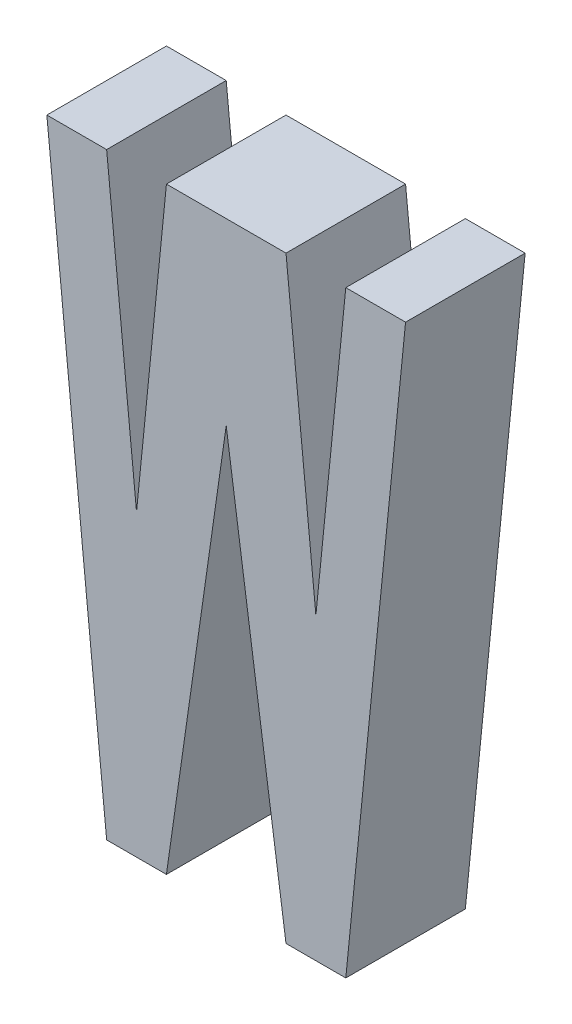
from build123d import *

# Parameters (mm, degrees)
BOSS_EXTRU_1_DEPTH = 10


with BuildPart() as part:
    # Esquisse1 → Boss.-Extru.1 (new body)
    with BuildSketch(Plane.XY):
        Polygon((0, 50), (5, 0), (10, 0), (15, 35), (20, 0), (25, 0), (30, 50), (25, 50), (22.5, 25), (20, 50), (10, 50), (7.5, 25), (5, 50), align=None)
    extrude(amount=BOSS_EXTRU_1_DEPTH)


solid = part.part
